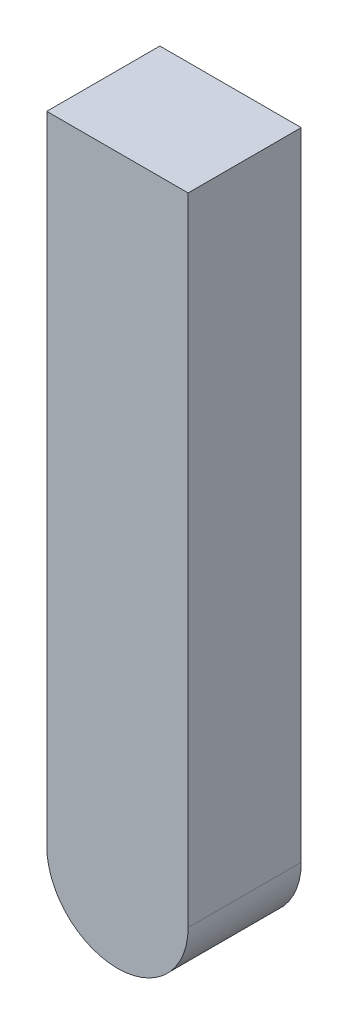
ISO-10303-21;
HEADER;
FILE_DESCRIPTION(('STEP AP214'),'2;1');
FILE_NAME('part.step','',(''),(''),'','','');
FILE_SCHEMA(('AUTOMOTIVE_DESIGN { 1 0 10303 214 1 1 1 1 }'));
ENDSEC;
DATA;
#1=APPLICATION_CONTEXT('core data for automotive mechanical design processes');
#2=APPLICATION_PROTOCOL_DEFINITION('international standard','automotive_design',2000,#1);
#3=PRODUCT_CONTEXT('',#1,'mechanical');
#4=PRODUCT('Part','Part','',(#3));
#5=PRODUCT_RELATED_PRODUCT_CATEGORY('part','',(#4));
#6=PRODUCT_DEFINITION_FORMATION('','',#4);
#7=PRODUCT_DEFINITION_CONTEXT('part definition',#1,'design');
#8=PRODUCT_DEFINITION('design','',#6,#7);
#9=PRODUCT_DEFINITION_SHAPE('','',#8);
#10=(LENGTH_UNIT() NAMED_UNIT(*) SI_UNIT(.MILLI.,.METRE.));
#11=(NAMED_UNIT(*) PLANE_ANGLE_UNIT() SI_UNIT($,.RADIAN.));
#12=(NAMED_UNIT(*) SI_UNIT($,.STERADIAN.) SOLID_ANGLE_UNIT());
#13=UNCERTAINTY_MEASURE_WITH_UNIT(LENGTH_MEASURE(1.E-05),#10,'distance_accuracy_value','');
#14=(GEOMETRIC_REPRESENTATION_CONTEXT(3) GLOBAL_UNCERTAINTY_ASSIGNED_CONTEXT((#13)) GLOBAL_UNIT_ASSIGNED_CONTEXT((#10,
#11,#12)) REPRESENTATION_CONTEXT('',''));
#15=CARTESIAN_POINT('',(0.,0.,0.));
#16=DIRECTION('',(0.,0.,1.));
#17=DIRECTION('',(1.,0.,0.));
#18=AXIS2_PLACEMENT_3D('',#15,#16,#17);
#19=CARTESIAN_POINT('',(0.,0.,2.));
#20=DIRECTION('',(0.,0.,-1.));
#21=DIRECTION('',(-1.,0.,0.));
#22=AXIS2_PLACEMENT_3D('',#19,#20,#21);
#23=CYLINDRICAL_SURFACE('',#22,1.25);
#24=CARTESIAN_POINT('',(0.,0.,0.));
#25=DIRECTION('',(0.,0.,1.));
#26=DIRECTION('',(1.,0.,0.));
#27=AXIS2_PLACEMENT_3D('',#24,#25,#26);
#28=CIRCLE('',#27,1.25);
#29=CARTESIAN_POINT('',(-1.25000000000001,0.,0.));
#30=VERTEX_POINT('',#29);
#31=CARTESIAN_POINT('',(1.24999999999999,0.,0.));
#32=VERTEX_POINT('',#31);
#33=EDGE_CURVE('E76',#30,#32,#28,.T.);
#34=ORIENTED_EDGE('',*,*,#33,.T.);
#35=DIRECTION('',(0.,0.,-1.));
#36=VECTOR('',#35,1.);
#37=CARTESIAN_POINT('',(1.24999999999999,0.,2.));
#38=LINE('',#37,#36);
#39=CARTESIAN_POINT('',(1.24999999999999,0.,2.));
#40=VERTEX_POINT('',#39);
#41=EDGE_CURVE('E11',#40,#32,#38,.T.);
#42=ORIENTED_EDGE('',*,*,#41,.F.);
#43=CARTESIAN_POINT('',(0.,0.,2.));
#44=DIRECTION('',(0.,0.,1.));
#45=DIRECTION('',(1.,0.,0.));
#46=AXIS2_PLACEMENT_3D('',#43,#44,#45);
#47=CIRCLE('',#46,1.25);
#48=CARTESIAN_POINT('',(-1.25000000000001,0.,2.));
#49=VERTEX_POINT('',#48);
#50=EDGE_CURVE('E94',#49,#40,#47,.T.);
#51=ORIENTED_EDGE('',*,*,#50,.F.);
#52=DIRECTION('',(0.,0.,-1.));
#53=VECTOR('',#52,1.);
#54=CARTESIAN_POINT('',(-1.25000000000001,0.,2.));
#55=LINE('',#54,#53);
#56=EDGE_CURVE('E88',#49,#30,#55,.T.);
#57=ORIENTED_EDGE('',*,*,#56,.T.);
#58=EDGE_LOOP('',(#34,#42,#51,#57));
#59=FACE_BOUND('',#58,.T.);
#60=ADVANCED_FACE('F32',(#59),#23,.T.);
#61=CARTESIAN_POINT('',(1.24999999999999,11.25,2.));
#62=DIRECTION('',(-1.,0.,0.));
#63=DIRECTION('',(0.,-1.,0.));
#64=AXIS2_PLACEMENT_3D('',#61,#62,#63);
#65=PLANE('',#64);
#66=DIRECTION('',(0.,1.,0.));
#67=VECTOR('',#66,1.);
#68=CARTESIAN_POINT('',(1.24999999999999,11.25,0.));
#69=LINE('',#68,#67);
#70=CARTESIAN_POINT('',(1.24999999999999,11.25,0.));
#71=VERTEX_POINT('',#70);
#72=EDGE_CURVE('E72',#32,#71,#69,.T.);
#73=ORIENTED_EDGE('',*,*,#72,.T.);
#74=DIRECTION('',(0.,0.,-1.));
#75=VECTOR('',#74,1.);
#76=CARTESIAN_POINT('',(1.24999999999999,11.25,2.));
#77=LINE('',#76,#75);
#78=CARTESIAN_POINT('',(1.24999999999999,11.25,2.));
#79=VERTEX_POINT('',#78);
#80=EDGE_CURVE('E39',#79,#71,#77,.T.);
#81=ORIENTED_EDGE('',*,*,#80,.F.);
#82=DIRECTION('',(0.,1.,0.));
#83=VECTOR('',#82,1.);
#84=CARTESIAN_POINT('',(1.24999999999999,11.25,2.));
#85=LINE('',#84,#83);
#86=EDGE_CURVE('E84',#40,#79,#85,.T.);
#87=ORIENTED_EDGE('',*,*,#86,.F.);
#88=ORIENTED_EDGE('',*,*,#41,.T.);
#89=EDGE_LOOP('',(#73,#81,#87,#88));
#90=FACE_BOUND('',#89,.T.);
#91=ADVANCED_FACE('F83',(#90),#65,.F.);
#92=CARTESIAN_POINT('',(1.24999999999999,11.25,2.));
#93=DIRECTION('',(0.,-1.,0.));
#94=DIRECTION('',(0.,0.,-1.));
#95=AXIS2_PLACEMENT_3D('',#92,#93,#94);
#96=PLANE('',#95);
#97=DIRECTION('',(-1.,0.,0.));
#98=VECTOR('',#97,1.);
#99=CARTESIAN_POINT('',(1.24999999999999,11.25,0.));
#100=LINE('',#99,#98);
#101=CARTESIAN_POINT('',(-1.25000000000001,11.25,0.));
#102=VERTEX_POINT('',#101);
#103=EDGE_CURVE('E77',#71,#102,#100,.T.);
#104=ORIENTED_EDGE('',*,*,#103,.T.);
#105=DIRECTION('',(0.,0.,-1.));
#106=VECTOR('',#105,1.);
#107=CARTESIAN_POINT('',(-1.25000000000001,11.25,2.));
#108=LINE('',#107,#106);
#109=CARTESIAN_POINT('',(-1.25000000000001,11.25,2.));
#110=VERTEX_POINT('',#109);
#111=EDGE_CURVE('E100',#110,#102,#108,.T.);
#112=ORIENTED_EDGE('',*,*,#111,.F.);
#113=DIRECTION('',(-1.,0.,0.));
#114=VECTOR('',#113,1.);
#115=CARTESIAN_POINT('',(1.24999999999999,11.25,2.));
#116=LINE('',#115,#114);
#117=EDGE_CURVE('E51',#79,#110,#116,.T.);
#118=ORIENTED_EDGE('',*,*,#117,.F.);
#119=ORIENTED_EDGE('',*,*,#80,.T.);
#120=EDGE_LOOP('',(#104,#112,#118,#119));
#121=FACE_BOUND('',#120,.T.);
#122=ADVANCED_FACE('F103',(#121),#96,.F.);
#123=CARTESIAN_POINT('',(-1.25000000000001,11.25,2.));
#124=DIRECTION('',(1.,0.,0.));
#125=DIRECTION('',(0.,1.,0.));
#126=AXIS2_PLACEMENT_3D('',#123,#124,#125);
#127=PLANE('',#126);
#128=DIRECTION('',(0.,-1.,0.));
#129=VECTOR('',#128,1.);
#130=CARTESIAN_POINT('',(-1.25000000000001,11.25,0.));
#131=LINE('',#130,#129);
#132=EDGE_CURVE('E92',#102,#30,#131,.T.);
#133=ORIENTED_EDGE('',*,*,#132,.T.);
#134=ORIENTED_EDGE('',*,*,#56,.F.);
#135=DIRECTION('',(0.,-1.,0.));
#136=VECTOR('',#135,1.);
#137=CARTESIAN_POINT('',(-1.25000000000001,11.25,2.));
#138=LINE('',#137,#136);
#139=EDGE_CURVE('E46',#110,#49,#138,.T.);
#140=ORIENTED_EDGE('',*,*,#139,.F.);
#141=ORIENTED_EDGE('',*,*,#111,.T.);
#142=EDGE_LOOP('',(#133,#134,#140,#141));
#143=FACE_BOUND('',#142,.T.);
#144=ADVANCED_FACE('F105',(#143),#127,.F.);
#145=CARTESIAN_POINT('',(0.,0.,2.));
#146=DIRECTION('',(0.,0.,1.));
#147=DIRECTION('',(1.,0.,0.));
#148=AXIS2_PLACEMENT_3D('',#145,#146,#147);
#149=PLANE('',#148);
#150=ORIENTED_EDGE('',*,*,#50,.T.);
#151=ORIENTED_EDGE('',*,*,#86,.T.);
#152=ORIENTED_EDGE('',*,*,#117,.T.);
#153=ORIENTED_EDGE('',*,*,#139,.T.);
#154=EDGE_LOOP('',(#150,#151,#152,#153));
#155=FACE_BOUND('',#154,.T.);
#156=ADVANCED_FACE('F106',(#155),#149,.T.);
#157=CARTESIAN_POINT('',(0.,0.,0.));
#158=DIRECTION('',(0.,0.,1.));
#159=DIRECTION('',(1.,0.,0.));
#160=AXIS2_PLACEMENT_3D('',#157,#158,#159);
#161=PLANE('',#160);
#162=ORIENTED_EDGE('',*,*,#33,.F.);
#163=ORIENTED_EDGE('',*,*,#132,.F.);
#164=ORIENTED_EDGE('',*,*,#103,.F.);
#165=ORIENTED_EDGE('',*,*,#72,.F.);
#166=EDGE_LOOP('',(#162,#163,#164,#165));
#167=FACE_BOUND('',#166,.T.);
#168=ADVANCED_FACE('F73',(#167),#161,.F.);
#169=CLOSED_SHELL('',(#60,#91,#122,#144,#156,#168));
#170=MANIFOLD_SOLID_BREP('B2',#169);
#171=ADVANCED_BREP_SHAPE_REPRESENTATION('',(#18,#170),#14);
#172=SHAPE_DEFINITION_REPRESENTATION(#9,#171);
ENDSEC;
END-ISO-10303-21;
